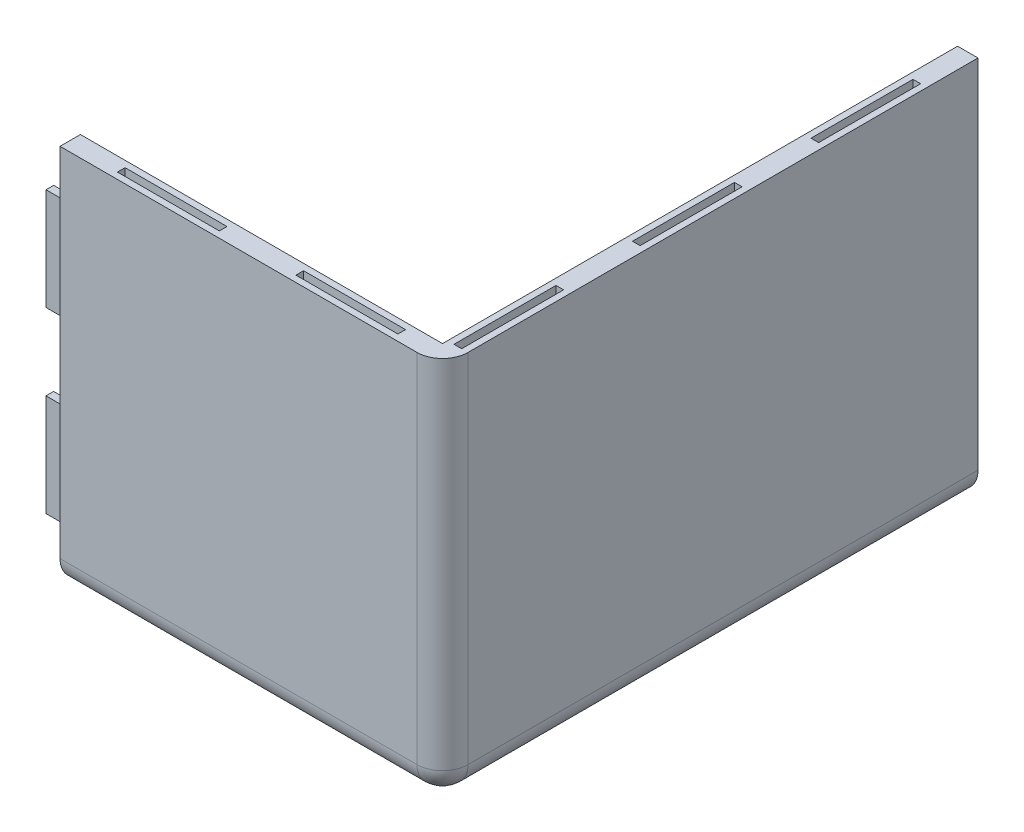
from build123d import *

# Parameters (mm, degrees)
CROQUIS1_W              = 150
CROQUIS1_H              = 210
SALIENTE_EXTRUIR1_DEPTH = 150
CROQUIS2_W              = 142
CROQUIS2_H              = 202
CORTAR_EXTRUIR1_DEPTH   = 142
CROQUIS5_W              = 40
CROQUIS5_H              = 3
CROQUIS5_W_2            = 3
CROQUIS5_H_2            = 40
SALIENTE_EXTRUIR3_DEPTH = 8
CROQUIS6_W              = 3
CROQUIS6_H              = 40
CROQUIS6_W_2            = 40
CROQUIS6_H_2            = 3
CORTAR_EXTRUIR2_DEPTH   = 8
REDONDEO1_R             = 10
CROQUIS3_W              = 40
CROQUIS3_H              = 3
CROQUIS3_W_2            = 3
CROQUIS3_H_2            = 40
CORTAR_EXTRUIR3_DEPTH   = 10
CROQUIS7_W              = 88
CROQUIS7_H              = 130
CORTAR_EXTRUIR4_DEPTH   = 10


with BuildPart() as part:
    # Croquis1 → Saliente-Extruir1 (new body)
    with BuildSketch(Plane(origin=(0, 0, 0), x_dir=(1, 0, 0), z_dir=(0, 1, 0))):
        with Locations((75, 105)):
            Rectangle(CROQUIS1_W, CROQUIS1_H)
    extrude(amount=SALIENTE_EXTRUIR1_DEPTH)

    # Croquis2 → Cortar-Extruir1 (cut)
    with BuildSketch(Plane(origin=(0, 150, 0), x_dir=(1, 0, 0), z_dir=(0, 1, 0))):
        with Locations((71, 109)):
            Rectangle(CROQUIS2_W, CROQUIS2_H)
    extrude(amount=-CORTAR_EXTRUIR1_DEPTH, mode=Mode.SUBTRACT)

    # Croquis5 → Saliente-Extruir3 (add)
    with BuildSketch(Plane.ZY):
        with Locations((-170, 4)):
            Rectangle(CROQUIS5_W, CROQUIS5_H)
        with Locations((-100, 4)):
            Rectangle(CROQUIS5_W, CROQUIS5_H)
        with Locations((-30, 4)):
            Rectangle(CROQUIS5_W, CROQUIS5_H)
        with Locations((-4, 110)):
            Rectangle(CROQUIS5_W_2, CROQUIS5_H_2)
        with Locations((-4, 40)):
            Rectangle(CROQUIS5_W_2, CROQUIS5_H_2)
    extrude(amount=SALIENTE_EXTRUIR3_DEPTH)

    # Croquis6 → Cortar-Extruir2 (cut)
    with BuildSketch(Plane(origin=(0, 0, -210), x_dir=(-1, 0, 0), z_dir=(0, 0, -1))):
        with Locations((-146, 110)):
            Rectangle(CROQUIS6_W, CROQUIS6_H)
        with Locations((-146, 40)):
            Rectangle(CROQUIS6_W, CROQUIS6_H)
        with Locations((-110, 4)):
            Rectangle(CROQUIS6_W_2, CROQUIS6_H_2)
        with Locations((-40, 4)):
            Rectangle(CROQUIS6_W_2, CROQUIS6_H_2)
    extrude(amount=-CORTAR_EXTRUIR2_DEPTH, mode=Mode.SUBTRACT)

    # Redondeo1
    redondeo1_edges = [part.edges().sort_by_distance(p)[0] for p in [
        (150, 0, -105),
        (75, 0, 0),
        (150, 75, 0),
    ]]
    fillet(redondeo1_edges, radius=REDONDEO1_R)

    # Croquis3 → Cortar-Extruir3 (cut)
    with BuildSketch(Plane(origin=(0, 150, 0), x_dir=(1, 0, 0), z_dir=(0, 1, 0))):
        with Locations((40, 4)):
            Rectangle(CROQUIS3_W, CROQUIS3_H)
        with Locations((110, 4)):
            Rectangle(CROQUIS3_W, CROQUIS3_H)
        with Locations((146, 170)):
            Rectangle(CROQUIS3_W_2, CROQUIS3_H_2)
        with Locations((146, 100)):
            Rectangle(CROQUIS3_W_2, CROQUIS3_H_2)
        with Locations((146, 30)):
            Rectangle(CROQUIS3_W_2, CROQUIS3_H_2)
    extrude(amount=-CORTAR_EXTRUIR3_DEPTH, mode=Mode.SUBTRACT)

    # Croquis7 → Cortar-Extruir4 (cut)
    with BuildSketch(Plane.XZ):
        with Locations((36, -145)):
            Rectangle(CROQUIS7_W, CROQUIS7_H)
    extrude(amount=-CORTAR_EXTRUIR4_DEPTH, mode=Mode.SUBTRACT)


solid = part.part
